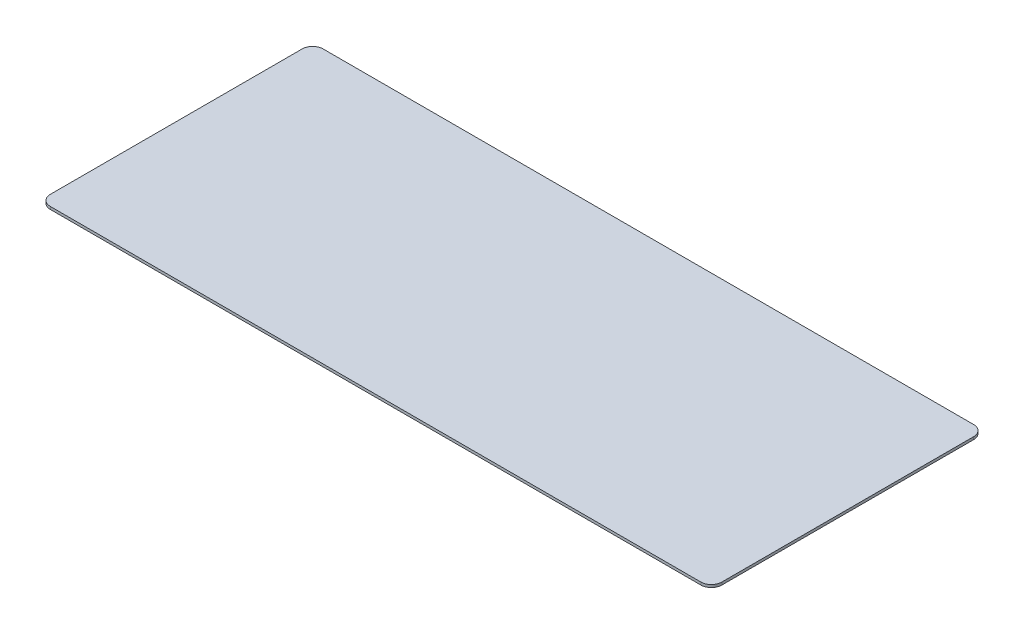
ISO-10303-21;
HEADER;
FILE_DESCRIPTION(('STEP AP214'),'2;1');
FILE_NAME('part.step','',(''),(''),'','','');
FILE_SCHEMA(('AUTOMOTIVE_DESIGN { 1 0 10303 214 1 1 1 1 }'));
ENDSEC;
DATA;
#1=APPLICATION_CONTEXT('core data for automotive mechanical design processes');
#2=APPLICATION_PROTOCOL_DEFINITION('international standard','automotive_design',2000,#1);
#3=PRODUCT_CONTEXT('',#1,'mechanical');
#4=PRODUCT('Part','Part','',(#3));
#5=PRODUCT_RELATED_PRODUCT_CATEGORY('part','',(#4));
#6=PRODUCT_DEFINITION_FORMATION('','',#4);
#7=PRODUCT_DEFINITION_CONTEXT('part definition',#1,'design');
#8=PRODUCT_DEFINITION('design','',#6,#7);
#9=PRODUCT_DEFINITION_SHAPE('','',#8);
#10=(LENGTH_UNIT() NAMED_UNIT(*) SI_UNIT(.MILLI.,.METRE.));
#11=(NAMED_UNIT(*) PLANE_ANGLE_UNIT() SI_UNIT($,.RADIAN.));
#12=(NAMED_UNIT(*) SI_UNIT($,.STERADIAN.) SOLID_ANGLE_UNIT());
#13=UNCERTAINTY_MEASURE_WITH_UNIT(LENGTH_MEASURE(1.E-05),#10,'distance_accuracy_value','');
#14=(GEOMETRIC_REPRESENTATION_CONTEXT(3) GLOBAL_UNCERTAINTY_ASSIGNED_CONTEXT((#13)) GLOBAL_UNIT_ASSIGNED_CONTEXT((#10,
#11,#12)) REPRESENTATION_CONTEXT('',''));
#15=CARTESIAN_POINT('',(0.,0.,0.));
#16=DIRECTION('',(0.,0.,1.));
#17=DIRECTION('',(1.,0.,0.));
#18=AXIS2_PLACEMENT_3D('',#15,#16,#17);
#19=CARTESIAN_POINT('',(-812.8,6.35,330.2));
#20=DIRECTION('',(1.,0.,0.));
#21=DIRECTION('',(0.,0.,-1.));
#22=AXIS2_PLACEMENT_3D('',#19,#20,#21);
#23=PLANE('',#22);
#24=DIRECTION('',(0.,0.,1.));
#25=VECTOR('',#24,1.);
#26=CARTESIAN_POINT('',(-812.8,0.,330.2));
#27=LINE('',#26,#25);
#28=CARTESIAN_POINT('',(-812.8,0.,-304.8));
#29=VERTEX_POINT('',#28);
#30=CARTESIAN_POINT('',(-812.8,0.,304.8));
#31=VERTEX_POINT('',#30);
#32=EDGE_CURVE('E128',#29,#31,#27,.T.);
#33=ORIENTED_EDGE('',*,*,#32,.T.);
#34=DIRECTION('',(0.,-1.,0.));
#35=VECTOR('',#34,1.);
#36=CARTESIAN_POINT('',(-812.8,6.35,304.8));
#37=LINE('',#36,#35);
#38=CARTESIAN_POINT('',(-812.8,6.35,304.8));
#39=VERTEX_POINT('',#38);
#40=EDGE_CURVE('E11',#31,#39,#37,.F.);
#41=ORIENTED_EDGE('',*,*,#40,.T.);
#42=DIRECTION('',(0.,0.,1.));
#43=VECTOR('',#42,1.);
#44=CARTESIAN_POINT('',(-812.8,6.35,330.2));
#45=LINE('',#44,#43);
#46=CARTESIAN_POINT('',(-812.8,6.35,-304.8));
#47=VERTEX_POINT('',#46);
#48=EDGE_CURVE('E126',#47,#39,#45,.T.);
#49=ORIENTED_EDGE('',*,*,#48,.F.);
#50=DIRECTION('',(0.,-1.,0.));
#51=VECTOR('',#50,1.);
#52=CARTESIAN_POINT('',(-812.8,6.35,-304.8));
#53=LINE('',#52,#51);
#54=EDGE_CURVE('E40',#47,#29,#53,.T.);
#55=ORIENTED_EDGE('',*,*,#54,.T.);
#56=EDGE_LOOP('',(#33,#41,#49,#55));
#57=FACE_BOUND('',#56,.T.);
#58=ADVANCED_FACE('F32',(#57),#23,.F.);
#59=CARTESIAN_POINT('',(812.8,6.35,330.2));
#60=DIRECTION('',(0.,0.,-1.));
#61=DIRECTION('',(-1.,0.,0.));
#62=AXIS2_PLACEMENT_3D('',#59,#60,#61);
#63=PLANE('',#62);
#64=DIRECTION('',(1.,0.,0.));
#65=VECTOR('',#64,1.);
#66=CARTESIAN_POINT('',(812.8,0.,330.2));
#67=LINE('',#66,#65);
#68=CARTESIAN_POINT('',(-787.4,0.,330.2));
#69=VERTEX_POINT('',#68);
#70=CARTESIAN_POINT('',(787.4,0.,330.2));
#71=VERTEX_POINT('',#70);
#72=EDGE_CURVE('E124',#69,#71,#67,.T.);
#73=ORIENTED_EDGE('',*,*,#72,.T.);
#74=DIRECTION('',(0.,-1.,0.));
#75=VECTOR('',#74,1.);
#76=CARTESIAN_POINT('',(787.4,6.35,330.2));
#77=LINE('',#76,#75);
#78=CARTESIAN_POINT('',(787.4,6.35,330.2));
#79=VERTEX_POINT('',#78);
#80=EDGE_CURVE('E103',#71,#79,#77,.F.);
#81=ORIENTED_EDGE('',*,*,#80,.T.);
#82=DIRECTION('',(1.,0.,0.));
#83=VECTOR('',#82,1.);
#84=CARTESIAN_POINT('',(812.8,6.35,330.2));
#85=LINE('',#84,#83);
#86=CARTESIAN_POINT('',(-787.4,6.35,330.2));
#87=VERTEX_POINT('',#86);
#88=EDGE_CURVE('E164',#87,#79,#85,.T.);
#89=ORIENTED_EDGE('',*,*,#88,.F.);
#90=DIRECTION('',(0.,-1.,0.));
#91=VECTOR('',#90,1.);
#92=CARTESIAN_POINT('',(-787.4,6.35,330.2));
#93=LINE('',#92,#91);
#94=EDGE_CURVE('E108',#87,#69,#93,.T.);
#95=ORIENTED_EDGE('',*,*,#94,.T.);
#96=EDGE_LOOP('',(#73,#81,#89,#95));
#97=FACE_BOUND('',#96,.T.);
#98=ADVANCED_FACE('F174',(#97),#63,.F.);
#99=CARTESIAN_POINT('',(812.8,6.35,330.2));
#100=DIRECTION('',(-1.,0.,0.));
#101=DIRECTION('',(0.,0.,1.));
#102=AXIS2_PLACEMENT_3D('',#99,#100,#101);
#103=PLANE('',#102);
#104=DIRECTION('',(0.,0.,-1.));
#105=VECTOR('',#104,1.);
#106=CARTESIAN_POINT('',(812.8,6.35,330.2));
#107=LINE('',#106,#105);
#108=CARTESIAN_POINT('',(812.8,6.35,304.8));
#109=VERTEX_POINT('',#108);
#110=CARTESIAN_POINT('',(812.8,6.35,-304.8));
#111=VERTEX_POINT('',#110);
#112=EDGE_CURVE('E117',#109,#111,#107,.T.);
#113=ORIENTED_EDGE('',*,*,#112,.F.);
#114=DIRECTION('',(0.,-1.,0.));
#115=VECTOR('',#114,1.);
#116=CARTESIAN_POINT('',(812.8,6.35,304.8));
#117=LINE('',#116,#115);
#118=CARTESIAN_POINT('',(812.8,0.,304.8));
#119=VERTEX_POINT('',#118);
#120=EDGE_CURVE('E102',#109,#119,#117,.T.);
#121=ORIENTED_EDGE('',*,*,#120,.T.);
#122=DIRECTION('',(0.,0.,-1.));
#123=VECTOR('',#122,1.);
#124=CARTESIAN_POINT('',(812.8,0.,330.2));
#125=LINE('',#124,#123);
#126=CARTESIAN_POINT('',(812.8,0.,-304.8));
#127=VERTEX_POINT('',#126);
#128=EDGE_CURVE('E115',#119,#127,#125,.T.);
#129=ORIENTED_EDGE('',*,*,#128,.T.);
#130=DIRECTION('',(0.,-1.,0.));
#131=VECTOR('',#130,1.);
#132=CARTESIAN_POINT('',(812.8,6.35,-304.8));
#133=LINE('',#132,#131);
#134=EDGE_CURVE('E119',#127,#111,#133,.F.);
#135=ORIENTED_EDGE('',*,*,#134,.T.);
#136=EDGE_LOOP('',(#113,#121,#129,#135));
#137=FACE_BOUND('',#136,.T.);
#138=ADVANCED_FACE('F114',(#137),#103,.F.);
#139=CARTESIAN_POINT('',(812.8,6.35,-330.2));
#140=DIRECTION('',(0.,0.,1.));
#141=DIRECTION('',(1.,0.,0.));
#142=AXIS2_PLACEMENT_3D('',#139,#140,#141);
#143=PLANE('',#142);
#144=DIRECTION('',(-1.,0.,0.));
#145=VECTOR('',#144,1.);
#146=CARTESIAN_POINT('',(812.8,6.35,-330.2));
#147=LINE('',#146,#145);
#148=CARTESIAN_POINT('',(787.4,6.35,-330.2));
#149=VERTEX_POINT('',#148);
#150=CARTESIAN_POINT('',(-787.4,6.35,-330.2));
#151=VERTEX_POINT('',#150);
#152=EDGE_CURVE('E132',#149,#151,#147,.T.);
#153=ORIENTED_EDGE('',*,*,#152,.F.);
#154=DIRECTION('',(0.,-1.,0.));
#155=VECTOR('',#154,1.);
#156=CARTESIAN_POINT('',(787.4,6.35,-330.2));
#157=LINE('',#156,#155);
#158=CARTESIAN_POINT('',(787.4,0.,-330.2));
#159=VERTEX_POINT('',#158);
#160=EDGE_CURVE('E149',#149,#159,#157,.T.);
#161=ORIENTED_EDGE('',*,*,#160,.T.);
#162=DIRECTION('',(-1.,0.,0.));
#163=VECTOR('',#162,1.);
#164=CARTESIAN_POINT('',(812.8,0.,-330.2));
#165=LINE('',#164,#163);
#166=CARTESIAN_POINT('',(-787.4,0.,-330.2));
#167=VERTEX_POINT('',#166);
#168=EDGE_CURVE('E123',#159,#167,#165,.T.);
#169=ORIENTED_EDGE('',*,*,#168,.T.);
#170=DIRECTION('',(0.,-1.,0.));
#171=VECTOR('',#170,1.);
#172=CARTESIAN_POINT('',(-787.4,6.35,-330.2));
#173=LINE('',#172,#171);
#174=EDGE_CURVE('E47',#167,#151,#173,.F.);
#175=ORIENTED_EDGE('',*,*,#174,.T.);
#176=EDGE_LOOP('',(#153,#161,#169,#175));
#177=FACE_BOUND('',#176,.T.);
#178=ADVANCED_FACE('F178',(#177),#143,.F.);
#179=CARTESIAN_POINT('',(-812.8,6.35,-330.2));
#180=DIRECTION('',(0.,1.,0.));
#181=DIRECTION('',(0.,0.,1.));
#182=AXIS2_PLACEMENT_3D('',#179,#180,#181);
#183=PLANE('',#182);
#184=ORIENTED_EDGE('',*,*,#88,.T.);
#185=CARTESIAN_POINT('',(787.4,6.35,304.8));
#186=DIRECTION('',(0.,1.,0.));
#187=DIRECTION('',(0.,0.,1.));
#188=AXIS2_PLACEMENT_3D('',#185,#186,#187);
#189=CIRCLE('',#188,25.4);
#190=EDGE_CURVE('E146',#79,#109,#189,.T.);
#191=ORIENTED_EDGE('',*,*,#190,.T.);
#192=ORIENTED_EDGE('',*,*,#112,.T.);
#193=CARTESIAN_POINT('',(787.4,6.35,-304.8));
#194=DIRECTION('',(0.,1.,0.));
#195=DIRECTION('',(0.,0.,1.));
#196=AXIS2_PLACEMENT_3D('',#193,#194,#195);
#197=CIRCLE('',#196,25.4);
#198=EDGE_CURVE('E54',#111,#149,#197,.T.);
#199=ORIENTED_EDGE('',*,*,#198,.T.);
#200=ORIENTED_EDGE('',*,*,#152,.T.);
#201=CARTESIAN_POINT('',(-787.4,6.35,-304.8));
#202=DIRECTION('',(0.,1.,0.));
#203=DIRECTION('',(0.,0.,1.));
#204=AXIS2_PLACEMENT_3D('',#201,#202,#203);
#205=CIRCLE('',#204,25.4);
#206=EDGE_CURVE('E141',#151,#47,#205,.T.);
#207=ORIENTED_EDGE('',*,*,#206,.T.);
#208=ORIENTED_EDGE('',*,*,#48,.T.);
#209=CARTESIAN_POINT('',(-787.4,6.35,304.8));
#210=DIRECTION('',(0.,1.,0.));
#211=DIRECTION('',(0.,0.,1.));
#212=AXIS2_PLACEMENT_3D('',#209,#210,#211);
#213=CIRCLE('',#212,25.4);
#214=EDGE_CURVE('E143',#39,#87,#213,.T.);
#215=ORIENTED_EDGE('',*,*,#214,.T.);
#216=EDGE_LOOP('',(#184,#191,#192,#199,#200,#207,#208,#215));
#217=FACE_BOUND('',#216,.T.);
#218=ADVANCED_FACE('F168',(#217),#183,.T.);
#219=CARTESIAN_POINT('',(-812.8,0.,-330.2));
#220=DIRECTION('',(0.,1.,0.));
#221=DIRECTION('',(0.,0.,1.));
#222=AXIS2_PLACEMENT_3D('',#219,#220,#221);
#223=PLANE('',#222);
#224=ORIENTED_EDGE('',*,*,#128,.F.);
#225=CARTESIAN_POINT('',(787.4,0.,304.8));
#226=DIRECTION('',(0.,1.,0.));
#227=DIRECTION('',(0.,0.,1.));
#228=AXIS2_PLACEMENT_3D('',#225,#226,#227);
#229=CIRCLE('',#228,25.4);
#230=EDGE_CURVE('E98',#119,#71,#229,.F.);
#231=ORIENTED_EDGE('',*,*,#230,.T.);
#232=ORIENTED_EDGE('',*,*,#72,.F.);
#233=CARTESIAN_POINT('',(-787.4,0.,304.8));
#234=DIRECTION('',(0.,1.,0.));
#235=DIRECTION('',(0.,0.,1.));
#236=AXIS2_PLACEMENT_3D('',#233,#234,#235);
#237=CIRCLE('',#236,25.4);
#238=EDGE_CURVE('E135',#69,#31,#237,.F.);
#239=ORIENTED_EDGE('',*,*,#238,.T.);
#240=ORIENTED_EDGE('',*,*,#32,.F.);
#241=CARTESIAN_POINT('',(-787.4,0.,-304.8));
#242=DIRECTION('',(0.,1.,0.));
#243=DIRECTION('',(0.,0.,1.));
#244=AXIS2_PLACEMENT_3D('',#241,#242,#243);
#245=CIRCLE('',#244,25.4);
#246=EDGE_CURVE('E118',#29,#167,#245,.F.);
#247=ORIENTED_EDGE('',*,*,#246,.T.);
#248=ORIENTED_EDGE('',*,*,#168,.F.);
#249=CARTESIAN_POINT('',(787.4,0.,-304.8));
#250=DIRECTION('',(0.,1.,0.));
#251=DIRECTION('',(0.,0.,1.));
#252=AXIS2_PLACEMENT_3D('',#249,#250,#251);
#253=CIRCLE('',#252,25.4);
#254=EDGE_CURVE('E109',#159,#127,#253,.F.);
#255=ORIENTED_EDGE('',*,*,#254,.T.);
#256=EDGE_LOOP('',(#224,#231,#232,#239,#240,#247,#248,#255));
#257=FACE_BOUND('',#256,.T.);
#258=ADVANCED_FACE('F121',(#257),#223,.F.);
#259=CARTESIAN_POINT('',(787.4,6.35,304.8));
#260=DIRECTION('',(0.,-1.,0.));
#261=DIRECTION('',(0.,0.,-1.));
#262=AXIS2_PLACEMENT_3D('',#259,#260,#261);
#263=CYLINDRICAL_SURFACE('',#262,25.4);
#264=ORIENTED_EDGE('',*,*,#190,.F.);
#265=ORIENTED_EDGE('',*,*,#80,.F.);
#266=ORIENTED_EDGE('',*,*,#230,.F.);
#267=ORIENTED_EDGE('',*,*,#120,.F.);
#268=EDGE_LOOP('',(#264,#265,#266,#267));
#269=FACE_BOUND('',#268,.T.);
#270=ADVANCED_FACE('F101',(#269),#263,.T.);
#271=CARTESIAN_POINT('',(787.4,6.35,-304.8));
#272=DIRECTION('',(0.,-1.,0.));
#273=DIRECTION('',(0.,0.,-1.));
#274=AXIS2_PLACEMENT_3D('',#271,#272,#273);
#275=CYLINDRICAL_SURFACE('',#274,25.4);
#276=ORIENTED_EDGE('',*,*,#198,.F.);
#277=ORIENTED_EDGE('',*,*,#134,.F.);
#278=ORIENTED_EDGE('',*,*,#254,.F.);
#279=ORIENTED_EDGE('',*,*,#160,.F.);
#280=EDGE_LOOP('',(#276,#277,#278,#279));
#281=FACE_BOUND('',#280,.T.);
#282=ADVANCED_FACE('F177',(#281),#275,.T.);
#283=CARTESIAN_POINT('',(-787.4,6.35,304.8));
#284=DIRECTION('',(0.,-1.,0.));
#285=DIRECTION('',(0.,0.,-1.));
#286=AXIS2_PLACEMENT_3D('',#283,#284,#285);
#287=CYLINDRICAL_SURFACE('',#286,25.4);
#288=ORIENTED_EDGE('',*,*,#214,.F.);
#289=ORIENTED_EDGE('',*,*,#40,.F.);
#290=ORIENTED_EDGE('',*,*,#238,.F.);
#291=ORIENTED_EDGE('',*,*,#94,.F.);
#292=EDGE_LOOP('',(#288,#289,#290,#291));
#293=FACE_BOUND('',#292,.T.);
#294=ADVANCED_FACE('F172',(#293),#287,.T.);
#295=CARTESIAN_POINT('',(-787.4,6.35,-304.8));
#296=DIRECTION('',(0.,-1.,0.));
#297=DIRECTION('',(0.,0.,-1.));
#298=AXIS2_PLACEMENT_3D('',#295,#296,#297);
#299=CYLINDRICAL_SURFACE('',#298,25.4);
#300=ORIENTED_EDGE('',*,*,#206,.F.);
#301=ORIENTED_EDGE('',*,*,#174,.F.);
#302=ORIENTED_EDGE('',*,*,#246,.F.);
#303=ORIENTED_EDGE('',*,*,#54,.F.);
#304=EDGE_LOOP('',(#300,#301,#302,#303));
#305=FACE_BOUND('',#304,.T.);
#306=ADVANCED_FACE('F34',(#305),#299,.T.);
#307=CLOSED_SHELL('',(#58,#98,#138,#178,#218,#258,#270,#282,#294,#306));
#308=MANIFOLD_SOLID_BREP('B2',#307);
#309=ADVANCED_BREP_SHAPE_REPRESENTATION('',(#18,#308),#14);
#310=SHAPE_DEFINITION_REPRESENTATION(#9,#309);
ENDSEC;
END-ISO-10303-21;
